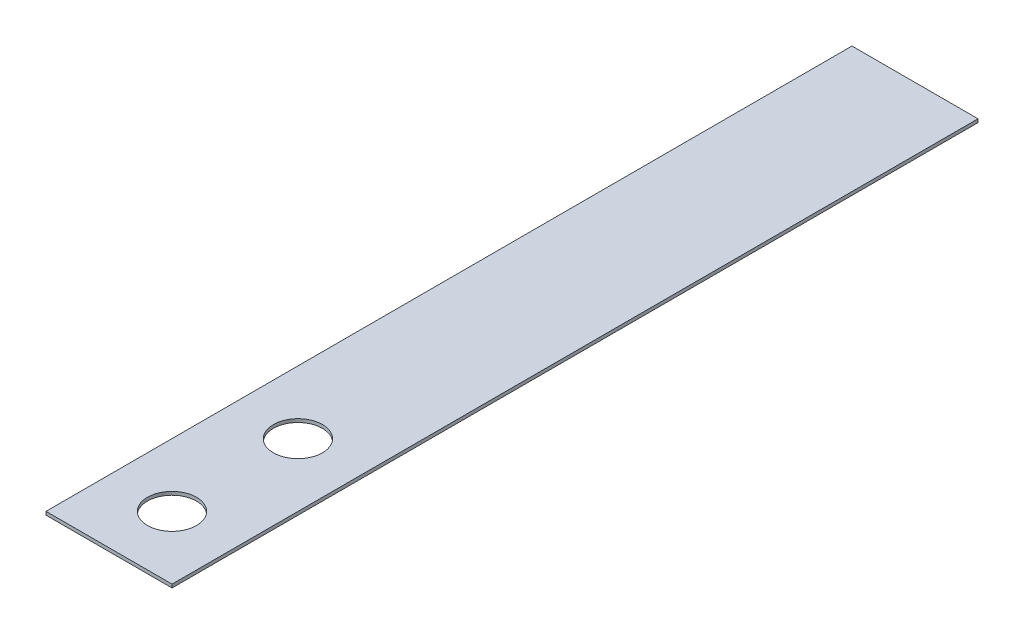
ISO-10303-21;
HEADER;
FILE_DESCRIPTION(('STEP AP214'),'2;1');
FILE_NAME('part.step','',(''),(''),'','','');
FILE_SCHEMA(('AUTOMOTIVE_DESIGN { 1 0 10303 214 1 1 1 1 }'));
ENDSEC;
DATA;
#1=APPLICATION_CONTEXT('core data for automotive mechanical design processes');
#2=APPLICATION_PROTOCOL_DEFINITION('international standard','automotive_design',2000,#1);
#3=PRODUCT_CONTEXT('',#1,'mechanical');
#4=PRODUCT('Part','Part','',(#3));
#5=PRODUCT_RELATED_PRODUCT_CATEGORY('part','',(#4));
#6=PRODUCT_DEFINITION_FORMATION('','',#4);
#7=PRODUCT_DEFINITION_CONTEXT('part definition',#1,'design');
#8=PRODUCT_DEFINITION('design','',#6,#7);
#9=PRODUCT_DEFINITION_SHAPE('','',#8);
#10=(LENGTH_UNIT() NAMED_UNIT(*) SI_UNIT(.MILLI.,.METRE.));
#11=(NAMED_UNIT(*) PLANE_ANGLE_UNIT() SI_UNIT($,.RADIAN.));
#12=(NAMED_UNIT(*) SI_UNIT($,.STERADIAN.) SOLID_ANGLE_UNIT());
#13=UNCERTAINTY_MEASURE_WITH_UNIT(LENGTH_MEASURE(1.E-05),#10,'distance_accuracy_value','');
#14=(GEOMETRIC_REPRESENTATION_CONTEXT(3) GLOBAL_UNCERTAINTY_ASSIGNED_CONTEXT((#13)) GLOBAL_UNIT_ASSIGNED_CONTEXT((#10,
#11,#12)) REPRESENTATION_CONTEXT('',''));
#15=CARTESIAN_POINT('',(0.,0.,0.));
#16=DIRECTION('',(0.,0.,1.));
#17=DIRECTION('',(1.,0.,0.));
#18=AXIS2_PLACEMENT_3D('',#15,#16,#17);
#19=CARTESIAN_POINT('',(4.76631,-0.254,9.525));
#20=DIRECTION('',(1.,0.,0.));
#21=DIRECTION('',(0.,0.,-1.));
#22=AXIS2_PLACEMENT_3D('',#19,#20,#21);
#23=PLANE('',#22);
#24=DIRECTION('',(0.,0.,-1.));
#25=VECTOR('',#24,1.);
#26=CARTESIAN_POINT('',(4.76631,0.,9.525));
#27=LINE('',#26,#25);
#28=CARTESIAN_POINT('',(4.76631,0.,9.525));
#29=VERTEX_POINT('',#28);
#30=CARTESIAN_POINT('',(4.76631,0.,-51.435));
#31=VERTEX_POINT('',#30);
#32=EDGE_CURVE('E97',#29,#31,#27,.T.);
#33=ORIENTED_EDGE('',*,*,#32,.F.);
#34=DIRECTION('',(0.,1.,0.));
#35=VECTOR('',#34,1.);
#36=CARTESIAN_POINT('',(4.76631,-0.254,9.525));
#37=LINE('',#36,#35);
#38=CARTESIAN_POINT('',(4.76631,-0.254,9.525));
#39=VERTEX_POINT('',#38);
#40=EDGE_CURVE('E11',#39,#29,#37,.T.);
#41=ORIENTED_EDGE('',*,*,#40,.F.);
#42=DIRECTION('',(0.,0.,-1.));
#43=VECTOR('',#42,1.);
#44=CARTESIAN_POINT('',(4.76631,-0.254,-9.525));
#45=LINE('',#44,#43);
#46=CARTESIAN_POINT('',(4.76631,-0.254,-51.435));
#47=VERTEX_POINT('',#46);
#48=EDGE_CURVE('E56',#39,#47,#45,.T.);
#49=ORIENTED_EDGE('',*,*,#48,.T.);
#50=DIRECTION('',(0.,1.,0.));
#51=VECTOR('',#50,1.);
#52=CARTESIAN_POINT('',(4.76631,-0.254,-51.435));
#53=LINE('',#52,#51);
#54=EDGE_CURVE('E41',#47,#31,#53,.T.);
#55=ORIENTED_EDGE('',*,*,#54,.T.);
#56=EDGE_LOOP('',(#33,#41,#49,#55));
#57=FACE_BOUND('',#56,.T.);
#58=ADVANCED_FACE('F37',(#57),#23,.T.);
#59=CARTESIAN_POINT('',(-4.76631,-0.254,9.525));
#60=DIRECTION('',(0.,0.,1.));
#61=DIRECTION('',(1.,0.,0.));
#62=AXIS2_PLACEMENT_3D('',#59,#60,#61);
#63=PLANE('',#62);
#64=DIRECTION('',(1.,0.,0.));
#65=VECTOR('',#64,1.);
#66=CARTESIAN_POINT('',(-4.76631,0.,9.525));
#67=LINE('',#66,#65);
#68=CARTESIAN_POINT('',(-4.76631,0.,9.525));
#69=VERTEX_POINT('',#68);
#70=EDGE_CURVE('E106',#69,#29,#67,.T.);
#71=ORIENTED_EDGE('',*,*,#70,.F.);
#72=DIRECTION('',(0.,1.,0.));
#73=VECTOR('',#72,1.);
#74=CARTESIAN_POINT('',(-4.76631,-0.254,9.525));
#75=LINE('',#74,#73);
#76=CARTESIAN_POINT('',(-4.76631,-0.254,9.525));
#77=VERTEX_POINT('',#76);
#78=EDGE_CURVE('E47',#77,#69,#75,.T.);
#79=ORIENTED_EDGE('',*,*,#78,.F.);
#80=DIRECTION('',(1.,0.,0.));
#81=VECTOR('',#80,1.);
#82=CARTESIAN_POINT('',(-4.76631,-0.254,9.525));
#83=LINE('',#82,#81);
#84=EDGE_CURVE('E94',#77,#39,#83,.T.);
#85=ORIENTED_EDGE('',*,*,#84,.T.);
#86=ORIENTED_EDGE('',*,*,#40,.T.);
#87=EDGE_LOOP('',(#71,#79,#85,#86));
#88=FACE_BOUND('',#87,.T.);
#89=ADVANCED_FACE('F113',(#88),#63,.T.);
#90=CARTESIAN_POINT('',(-4.76631,-0.254,9.525));
#91=DIRECTION('',(-1.,0.,0.));
#92=DIRECTION('',(0.,0.,1.));
#93=AXIS2_PLACEMENT_3D('',#90,#91,#92);
#94=PLANE('',#93);
#95=DIRECTION('',(0.,0.,1.));
#96=VECTOR('',#95,1.);
#97=CARTESIAN_POINT('',(-4.76631,0.,9.525));
#98=LINE('',#97,#96);
#99=CARTESIAN_POINT('',(-4.76631,0.,-51.435));
#100=VERTEX_POINT('',#99);
#101=EDGE_CURVE('E90',#100,#69,#98,.T.);
#102=ORIENTED_EDGE('',*,*,#101,.F.);
#103=DIRECTION('',(0.,1.,0.));
#104=VECTOR('',#103,1.);
#105=CARTESIAN_POINT('',(-4.76631,-0.254,-51.435));
#106=LINE('',#105,#104);
#107=CARTESIAN_POINT('',(-4.76631,-0.254,-51.435));
#108=VERTEX_POINT('',#107);
#109=EDGE_CURVE('E85',#108,#100,#106,.T.);
#110=ORIENTED_EDGE('',*,*,#109,.F.);
#111=DIRECTION('',(0.,0.,1.));
#112=VECTOR('',#111,1.);
#113=CARTESIAN_POINT('',(-4.76631,-0.254,-9.525));
#114=LINE('',#113,#112);
#115=EDGE_CURVE('E88',#108,#77,#114,.T.);
#116=ORIENTED_EDGE('',*,*,#115,.T.);
#117=ORIENTED_EDGE('',*,*,#78,.T.);
#118=EDGE_LOOP('',(#102,#110,#116,#117));
#119=FACE_BOUND('',#118,.T.);
#120=ADVANCED_FACE('F87',(#119),#94,.T.);
#121=CARTESIAN_POINT('',(-4.76631,-0.254,-51.435));
#122=DIRECTION('',(0.,0.,-1.));
#123=DIRECTION('',(-1.,0.,0.));
#124=AXIS2_PLACEMENT_3D('',#121,#122,#123);
#125=PLANE('',#124);
#126=DIRECTION('',(-1.,0.,0.));
#127=VECTOR('',#126,1.);
#128=CARTESIAN_POINT('',(-4.76631,0.,-51.435));
#129=LINE('',#128,#127);
#130=EDGE_CURVE('E102',#31,#100,#129,.T.);
#131=ORIENTED_EDGE('',*,*,#130,.F.);
#132=ORIENTED_EDGE('',*,*,#54,.F.);
#133=DIRECTION('',(-1.,0.,0.));
#134=VECTOR('',#133,1.);
#135=CARTESIAN_POINT('',(-4.76631,-0.254,-51.435));
#136=LINE('',#135,#134);
#137=EDGE_CURVE('E93',#47,#108,#136,.T.);
#138=ORIENTED_EDGE('',*,*,#137,.T.);
#139=ORIENTED_EDGE('',*,*,#109,.T.);
#140=EDGE_LOOP('',(#131,#132,#138,#139));
#141=FACE_BOUND('',#140,.T.);
#142=ADVANCED_FACE('F39',(#141),#125,.T.);
#143=CARTESIAN_POINT('',(0.,-0.254,0.));
#144=DIRECTION('',(0.,-1.,0.));
#145=DIRECTION('',(0.,0.,-1.));
#146=AXIS2_PLACEMENT_3D('',#143,#144,#145);
#147=PLANE('',#146);
#148=CARTESIAN_POINT('',(0.,-0.254,4.7625));
#149=DIRECTION('',(0.,-1.,0.));
#150=DIRECTION('',(0.,0.,-1.));
#151=AXIS2_PLACEMENT_3D('',#148,#149,#150);
#152=CIRCLE('',#151,1.8542);
#153=CARTESIAN_POINT('',(0.,-0.254,6.6167));
#154=VERTEX_POINT('',#153);
#155=EDGE_CURVE('E140',#154,#154,#152,.T.);
#156=ORIENTED_EDGE('',*,*,#155,.F.);
#157=EDGE_LOOP('',(#156));
#158=FACE_BOUND('',#157,.T.);
#159=CARTESIAN_POINT('',(0.,-0.254,-4.7625));
#160=DIRECTION('',(0.,-1.,0.));
#161=DIRECTION('',(0.,0.,-1.));
#162=AXIS2_PLACEMENT_3D('',#159,#160,#161);
#163=CIRCLE('',#162,1.8542);
#164=CARTESIAN_POINT('',(0.,-0.254,-2.9083));
#165=VERTEX_POINT('',#164);
#166=EDGE_CURVE('E104',#165,#165,#163,.T.);
#167=ORIENTED_EDGE('',*,*,#166,.F.);
#168=EDGE_LOOP('',(#167));
#169=FACE_BOUND('',#168,.T.);
#170=ORIENTED_EDGE('',*,*,#48,.F.);
#171=ORIENTED_EDGE('',*,*,#84,.F.);
#172=ORIENTED_EDGE('',*,*,#115,.F.);
#173=ORIENTED_EDGE('',*,*,#137,.F.);
#174=EDGE_LOOP('',(#170,#171,#172,#173));
#175=FACE_BOUND('',#174,.T.);
#176=ADVANCED_FACE('F92',(#158,#169,#175),#147,.T.);
#177=CARTESIAN_POINT('',(0.,0.,0.));
#178=DIRECTION('',(0.,-1.,0.));
#179=DIRECTION('',(0.,0.,-1.));
#180=AXIS2_PLACEMENT_3D('',#177,#178,#179);
#181=PLANE('',#180);
#182=CARTESIAN_POINT('',(0.,0.,4.7625));
#183=DIRECTION('',(0.,1.,0.));
#184=DIRECTION('',(0.,0.,-1.));
#185=AXIS2_PLACEMENT_3D('',#182,#183,#184);
#186=CIRCLE('',#185,1.8542);
#187=CARTESIAN_POINT('',(0.,0.,6.6167));
#188=VERTEX_POINT('',#187);
#189=EDGE_CURVE('E143',#188,#188,#186,.T.);
#190=ORIENTED_EDGE('',*,*,#189,.F.);
#191=EDGE_LOOP('',(#190));
#192=FACE_BOUND('',#191,.T.);
#193=CARTESIAN_POINT('',(0.,0.,-4.7625));
#194=DIRECTION('',(0.,1.,0.));
#195=DIRECTION('',(0.,0.,1.));
#196=AXIS2_PLACEMENT_3D('',#193,#194,#195);
#197=CIRCLE('',#196,1.8542);
#198=CARTESIAN_POINT('',(0.,0.,-2.9083));
#199=VERTEX_POINT('',#198);
#200=EDGE_CURVE('E145',#199,#199,#197,.T.);
#201=ORIENTED_EDGE('',*,*,#200,.F.);
#202=EDGE_LOOP('',(#201));
#203=FACE_BOUND('',#202,.T.);
#204=ORIENTED_EDGE('',*,*,#32,.T.);
#205=ORIENTED_EDGE('',*,*,#130,.T.);
#206=ORIENTED_EDGE('',*,*,#101,.T.);
#207=ORIENTED_EDGE('',*,*,#70,.T.);
#208=EDGE_LOOP('',(#204,#205,#206,#207));
#209=FACE_BOUND('',#208,.T.);
#210=ADVANCED_FACE('F111',(#192,#203,#209),#181,.F.);
#211=CARTESIAN_POINT('',(0.,-1.524,-4.7625));
#212=DIRECTION('',(0.,1.,0.));
#213=DIRECTION('',(0.,0.,1.));
#214=AXIS2_PLACEMENT_3D('',#211,#212,#213);
#215=CYLINDRICAL_SURFACE('',#214,1.8542);
#216=CARTESIAN_POINT('',(0.,-0.254,-2.9083));
#217=CARTESIAN_POINT('',(0.,-0.251354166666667,-2.9083));
#218=CARTESIAN_POINT('',(0.,-0.248708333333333,-2.9083));
#219=CARTESIAN_POINT('',(0.,-0.243416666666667,-2.9083));
#220=CARTESIAN_POINT('',(0.,-0.240770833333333,-2.9083));
#221=CARTESIAN_POINT('',(0.,-0.235479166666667,-2.9083));
#222=CARTESIAN_POINT('',(0.,-0.232833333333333,-2.9083));
#223=CARTESIAN_POINT('',(0.,-0.227541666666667,-2.9083));
#224=CARTESIAN_POINT('',(0.,-0.224895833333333,-2.9083));
#225=CARTESIAN_POINT('',(0.,-0.219604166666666,-2.9083));
#226=CARTESIAN_POINT('',(0.,-0.216958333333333,-2.9083));
#227=CARTESIAN_POINT('',(0.,-0.211666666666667,-2.9083));
#228=CARTESIAN_POINT('',(0.,-0.209020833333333,-2.9083));
#229=CARTESIAN_POINT('',(0.,-0.203729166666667,-2.9083));
#230=CARTESIAN_POINT('',(0.,-0.201083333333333,-2.9083));
#231=CARTESIAN_POINT('',(0.,-0.195791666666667,-2.9083));
#232=CARTESIAN_POINT('',(0.,-0.193145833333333,-2.9083));
#233=CARTESIAN_POINT('',(0.,-0.187854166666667,-2.9083));
#234=CARTESIAN_POINT('',(0.,-0.185208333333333,-2.9083));
#235=CARTESIAN_POINT('',(0.,-0.179916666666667,-2.9083));
#236=CARTESIAN_POINT('',(0.,-0.177270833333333,-2.9083));
#237=CARTESIAN_POINT('',(0.,-0.171979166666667,-2.9083));
#238=CARTESIAN_POINT('',(0.,-0.169333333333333,-2.9083));
#239=CARTESIAN_POINT('',(0.,-0.164041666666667,-2.9083));
#240=CARTESIAN_POINT('',(0.,-0.161395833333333,-2.9083));
#241=CARTESIAN_POINT('',(0.,-0.156104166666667,-2.9083));
#242=CARTESIAN_POINT('',(0.,-0.153458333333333,-2.9083));
#243=CARTESIAN_POINT('',(0.,-0.148166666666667,-2.9083));
#244=CARTESIAN_POINT('',(0.,-0.145520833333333,-2.9083));
#245=CARTESIAN_POINT('',(0.,-0.140229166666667,-2.9083));
#246=CARTESIAN_POINT('',(0.,-0.137583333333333,-2.9083));
#247=CARTESIAN_POINT('',(0.,-0.132291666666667,-2.9083));
#248=CARTESIAN_POINT('',(0.,-0.129645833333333,-2.9083));
#249=CARTESIAN_POINT('',(0.,-0.124354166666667,-2.9083));
#250=CARTESIAN_POINT('',(0.,-0.121708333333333,-2.9083));
#251=CARTESIAN_POINT('',(0.,-0.116416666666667,-2.9083));
#252=CARTESIAN_POINT('',(0.,-0.113770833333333,-2.9083));
#253=CARTESIAN_POINT('',(0.,-0.108479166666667,-2.9083));
#254=CARTESIAN_POINT('',(0.,-0.105833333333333,-2.9083));
#255=CARTESIAN_POINT('',(0.,-0.100541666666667,-2.9083));
#256=CARTESIAN_POINT('',(0.,-0.0978958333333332,-2.9083));
#257=CARTESIAN_POINT('',(0.,-0.0926041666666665,-2.9083));
#258=CARTESIAN_POINT('',(0.,-0.0899583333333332,-2.9083));
#259=CARTESIAN_POINT('',(0.,-0.0846666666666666,-2.9083));
#260=CARTESIAN_POINT('',(0.,-0.0820208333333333,-2.9083));
#261=CARTESIAN_POINT('',(0.,-0.0767291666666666,-2.9083));
#262=CARTESIAN_POINT('',(0.,-0.0740833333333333,-2.9083));
#263=CARTESIAN_POINT('',(0.,-0.0687916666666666,-2.9083));
#264=CARTESIAN_POINT('',(0.,-0.0661458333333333,-2.9083));
#265=CARTESIAN_POINT('',(0.,-0.0608541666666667,-2.9083));
#266=CARTESIAN_POINT('',(0.,-0.0582083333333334,-2.9083));
#267=CARTESIAN_POINT('',(0.,-0.0529166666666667,-2.9083));
#268=CARTESIAN_POINT('',(0.,-0.0502708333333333,-2.9083));
#269=CARTESIAN_POINT('',(0.,-0.0449791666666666,-2.9083));
#270=CARTESIAN_POINT('',(0.,-0.0423333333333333,-2.9083));
#271=CARTESIAN_POINT('',(0.,-0.0370416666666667,-2.9083));
#272=CARTESIAN_POINT('',(0.,-0.0343958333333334,-2.9083));
#273=CARTESIAN_POINT('',(0.,-0.0291041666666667,-2.9083));
#274=CARTESIAN_POINT('',(0.,-0.0264583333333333,-2.9083));
#275=CARTESIAN_POINT('',(0.,-0.0211666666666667,-2.9083));
#276=CARTESIAN_POINT('',(0.,-0.0185208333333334,-2.9083));
#277=CARTESIAN_POINT('',(0.,-0.0132291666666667,-2.9083));
#278=CARTESIAN_POINT('',(0.,-0.0105833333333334,-2.9083));
#279=CARTESIAN_POINT('',(0.,-0.00529166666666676,-2.9083));
#280=CARTESIAN_POINT('',(0.,-0.00264583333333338,-2.9083));
#281=CARTESIAN_POINT('',(0.,0.,-2.9083));
#282=B_SPLINE_CURVE_WITH_KNOTS('',3,(#216,#217,#218,#219,#220,#221,#222,#223,#224,#225,#226,
#227,#228,#229,#230,#231,#232,#233,#234,#235,#236,#237,#238,#239,#240,#241,#242,#243,#244,#245,
#246,#247,#248,#249,#250,#251,#252,#253,#254,#255,#256,#257,#258,#259,#260,#261,#262,#263,#264,
#265,#266,#267,#268,#269,#270,#271,#272,#273,#274,#275,#276,#277,#278,#279,#280,#281),
.UNSPECIFIED.,.F.,.F.,(4,2,2,2,2,2,2,2,2,2,2,2,2,2,2,2,2,2,2,2,2,2,2,2,2,2,2,2,2,2,2,2,4),(0.,
0.00793749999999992,0.015875,0.0238125,0.0317500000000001,0.0396875,0.0476249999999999,
0.0555625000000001,0.0635,0.0714374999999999,0.079375,0.0873124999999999,0.0952499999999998,
0.1031875,0.111125,0.1190625,0.127,0.1349375,0.142875,0.1508125,0.15875,0.1666875,0.174625,
0.1825625,0.1905,0.1984375,0.206375,0.2143125,0.22225,0.2301875,0.238125,0.2460625,0.254),.UNSPECIFIED.);
#283=EDGE_CURVE('BSEAM124',#165,#199,#282,.T.);
#284=ORIENTED_EDGE('',*,*,#166,.T.);
#285=ORIENTED_EDGE('',*,*,#200,.T.);
#286=ORIENTED_EDGE('',*,*,#283,.T.);
#287=ORIENTED_EDGE('',*,*,#283,.F.);
#288=EDGE_LOOP('',(#284,#286,#285,#287));
#289=FACE_BOUND('',#288,.T.);
#290=ADVANCED_FACE('F124',(#289),#215,.F.);
#291=CARTESIAN_POINT('',(0.,-1.524,4.7625));
#292=DIRECTION('',(0.,1.,0.));
#293=DIRECTION('',(0.,0.,1.));
#294=AXIS2_PLACEMENT_3D('',#291,#292,#293);
#295=CYLINDRICAL_SURFACE('',#294,1.8542);
#296=CARTESIAN_POINT('',(0.,-0.254,6.6167));
#297=CARTESIAN_POINT('',(0.,-0.251354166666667,6.6167));
#298=CARTESIAN_POINT('',(0.,-0.248708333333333,6.6167));
#299=CARTESIAN_POINT('',(0.,-0.243416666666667,6.6167));
#300=CARTESIAN_POINT('',(0.,-0.240770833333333,6.6167));
#301=CARTESIAN_POINT('',(0.,-0.235479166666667,6.6167));
#302=CARTESIAN_POINT('',(0.,-0.232833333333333,6.6167));
#303=CARTESIAN_POINT('',(0.,-0.227541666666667,6.6167));
#304=CARTESIAN_POINT('',(0.,-0.224895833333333,6.6167));
#305=CARTESIAN_POINT('',(0.,-0.219604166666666,6.6167));
#306=CARTESIAN_POINT('',(0.,-0.216958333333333,6.6167));
#307=CARTESIAN_POINT('',(0.,-0.211666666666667,6.6167));
#308=CARTESIAN_POINT('',(0.,-0.209020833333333,6.6167));
#309=CARTESIAN_POINT('',(0.,-0.203729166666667,6.6167));
#310=CARTESIAN_POINT('',(0.,-0.201083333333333,6.6167));
#311=CARTESIAN_POINT('',(0.,-0.195791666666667,6.6167));
#312=CARTESIAN_POINT('',(0.,-0.193145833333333,6.6167));
#313=CARTESIAN_POINT('',(0.,-0.187854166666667,6.6167));
#314=CARTESIAN_POINT('',(0.,-0.185208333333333,6.6167));
#315=CARTESIAN_POINT('',(0.,-0.179916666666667,6.6167));
#316=CARTESIAN_POINT('',(0.,-0.177270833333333,6.6167));
#317=CARTESIAN_POINT('',(0.,-0.171979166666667,6.6167));
#318=CARTESIAN_POINT('',(0.,-0.169333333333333,6.6167));
#319=CARTESIAN_POINT('',(0.,-0.164041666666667,6.6167));
#320=CARTESIAN_POINT('',(0.,-0.161395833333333,6.6167));
#321=CARTESIAN_POINT('',(0.,-0.156104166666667,6.6167));
#322=CARTESIAN_POINT('',(0.,-0.153458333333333,6.6167));
#323=CARTESIAN_POINT('',(0.,-0.148166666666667,6.6167));
#324=CARTESIAN_POINT('',(0.,-0.145520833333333,6.6167));
#325=CARTESIAN_POINT('',(0.,-0.140229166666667,6.6167));
#326=CARTESIAN_POINT('',(0.,-0.137583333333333,6.6167));
#327=CARTESIAN_POINT('',(0.,-0.132291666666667,6.6167));
#328=CARTESIAN_POINT('',(0.,-0.129645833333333,6.6167));
#329=CARTESIAN_POINT('',(0.,-0.124354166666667,6.6167));
#330=CARTESIAN_POINT('',(0.,-0.121708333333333,6.6167));
#331=CARTESIAN_POINT('',(0.,-0.116416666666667,6.6167));
#332=CARTESIAN_POINT('',(0.,-0.113770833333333,6.6167));
#333=CARTESIAN_POINT('',(0.,-0.108479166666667,6.6167));
#334=CARTESIAN_POINT('',(0.,-0.105833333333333,6.6167));
#335=CARTESIAN_POINT('',(0.,-0.100541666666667,6.6167));
#336=CARTESIAN_POINT('',(0.,-0.0978958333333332,6.6167));
#337=CARTESIAN_POINT('',(0.,-0.0926041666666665,6.6167));
#338=CARTESIAN_POINT('',(0.,-0.0899583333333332,6.6167));
#339=CARTESIAN_POINT('',(0.,-0.0846666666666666,6.6167));
#340=CARTESIAN_POINT('',(0.,-0.0820208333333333,6.6167));
#341=CARTESIAN_POINT('',(0.,-0.0767291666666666,6.6167));
#342=CARTESIAN_POINT('',(0.,-0.0740833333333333,6.6167));
#343=CARTESIAN_POINT('',(0.,-0.0687916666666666,6.6167));
#344=CARTESIAN_POINT('',(0.,-0.0661458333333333,6.6167));
#345=CARTESIAN_POINT('',(0.,-0.0608541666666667,6.6167));
#346=CARTESIAN_POINT('',(0.,-0.0582083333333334,6.6167));
#347=CARTESIAN_POINT('',(0.,-0.0529166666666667,6.6167));
#348=CARTESIAN_POINT('',(0.,-0.0502708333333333,6.6167));
#349=CARTESIAN_POINT('',(0.,-0.0449791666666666,6.6167));
#350=CARTESIAN_POINT('',(0.,-0.0423333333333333,6.6167));
#351=CARTESIAN_POINT('',(0.,-0.0370416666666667,6.6167));
#352=CARTESIAN_POINT('',(0.,-0.0343958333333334,6.6167));
#353=CARTESIAN_POINT('',(0.,-0.0291041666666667,6.6167));
#354=CARTESIAN_POINT('',(0.,-0.0264583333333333,6.6167));
#355=CARTESIAN_POINT('',(0.,-0.0211666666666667,6.6167));
#356=CARTESIAN_POINT('',(0.,-0.0185208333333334,6.6167));
#357=CARTESIAN_POINT('',(0.,-0.0132291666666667,6.6167));
#358=CARTESIAN_POINT('',(0.,-0.0105833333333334,6.6167));
#359=CARTESIAN_POINT('',(0.,-0.00529166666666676,6.6167));
#360=CARTESIAN_POINT('',(0.,-0.00264583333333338,6.6167));
#361=CARTESIAN_POINT('',(0.,0.,6.6167));
#362=B_SPLINE_CURVE_WITH_KNOTS('',3,(#296,#297,#298,#299,#300,#301,#302,#303,#304,#305,#306,
#307,#308,#309,#310,#311,#312,#313,#314,#315,#316,#317,#318,#319,#320,#321,#322,#323,#324,#325,
#326,#327,#328,#329,#330,#331,#332,#333,#334,#335,#336,#337,#338,#339,#340,#341,#342,#343,#344,
#345,#346,#347,#348,#349,#350,#351,#352,#353,#354,#355,#356,#357,#358,#359,#360,#361),
.UNSPECIFIED.,.F.,.F.,(4,2,2,2,2,2,2,2,2,2,2,2,2,2,2,2,2,2,2,2,2,2,2,2,2,2,2,2,2,2,2,2,4),(0.,
0.00793749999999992,0.015875,0.0238125,0.0317500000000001,0.0396875,0.0476249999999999,
0.0555625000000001,0.0635,0.0714374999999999,0.079375,0.0873124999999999,0.0952499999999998,
0.1031875,0.111125,0.1190625,0.127,0.1349375,0.142875,0.1508125,0.15875,0.1666875,0.174625,
0.1825625,0.1905,0.1984375,0.206375,0.2143125,0.22225,0.2301875,0.238125,0.2460625,0.254),.UNSPECIFIED.);
#363=EDGE_CURVE('BSEAM131',#154,#188,#362,.T.);
#364=ORIENTED_EDGE('',*,*,#155,.T.);
#365=ORIENTED_EDGE('',*,*,#189,.T.);
#366=ORIENTED_EDGE('',*,*,#363,.T.);
#367=ORIENTED_EDGE('',*,*,#363,.F.);
#368=EDGE_LOOP('',(#364,#366,#365,#367));
#369=FACE_BOUND('',#368,.T.);
#370=ADVANCED_FACE('F131',(#369),#295,.F.);
#371=CLOSED_SHELL('',(#58,#89,#120,#142,#176,#210,#290,#370));
#372=MANIFOLD_SOLID_BREP('B2',#371);
#373=ADVANCED_BREP_SHAPE_REPRESENTATION('',(#18,#372),#14);
#374=SHAPE_DEFINITION_REPRESENTATION(#9,#373);
ENDSEC;
END-ISO-10303-21;
